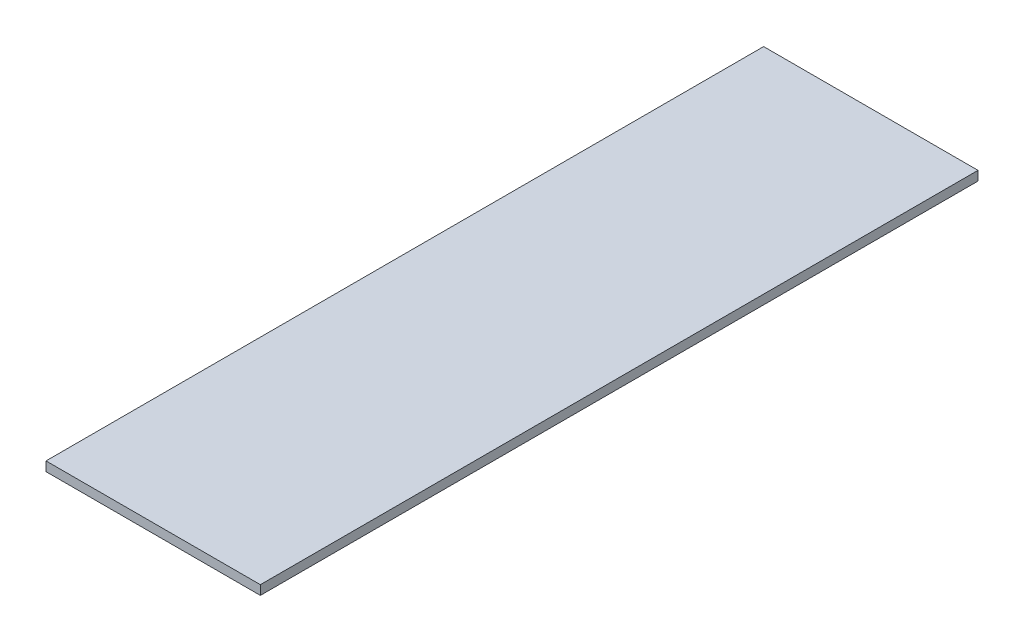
ISO-10303-21;
HEADER;
FILE_DESCRIPTION(('STEP AP214'),'2;1');
FILE_NAME('part.step','',(''),(''),'','','');
FILE_SCHEMA(('AUTOMOTIVE_DESIGN { 1 0 10303 214 1 1 1 1 }'));
ENDSEC;
DATA;
#1=APPLICATION_CONTEXT('core data for automotive mechanical design processes');
#2=APPLICATION_PROTOCOL_DEFINITION('international standard','automotive_design',2000,#1);
#3=PRODUCT_CONTEXT('',#1,'mechanical');
#4=PRODUCT('Part','Part','',(#3));
#5=PRODUCT_RELATED_PRODUCT_CATEGORY('part','',(#4));
#6=PRODUCT_DEFINITION_FORMATION('','',#4);
#7=PRODUCT_DEFINITION_CONTEXT('part definition',#1,'design');
#8=PRODUCT_DEFINITION('design','',#6,#7);
#9=PRODUCT_DEFINITION_SHAPE('','',#8);
#10=(LENGTH_UNIT() NAMED_UNIT(*) SI_UNIT(.MILLI.,.METRE.));
#11=(NAMED_UNIT(*) PLANE_ANGLE_UNIT() SI_UNIT($,.RADIAN.));
#12=(NAMED_UNIT(*) SI_UNIT($,.STERADIAN.) SOLID_ANGLE_UNIT());
#13=UNCERTAINTY_MEASURE_WITH_UNIT(LENGTH_MEASURE(1.E-05),#10,'distance_accuracy_value','');
#14=(GEOMETRIC_REPRESENTATION_CONTEXT(3) GLOBAL_UNCERTAINTY_ASSIGNED_CONTEXT((#13)) GLOBAL_UNIT_ASSIGNED_CONTEXT((#10,
#11,#12)) REPRESENTATION_CONTEXT('',''));
#15=CARTESIAN_POINT('',(0.,0.,0.));
#16=DIRECTION('',(0.,0.,1.));
#17=DIRECTION('',(1.,0.,0.));
#18=AXIS2_PLACEMENT_3D('',#15,#16,#17);
#19=CARTESIAN_POINT('',(-292.1,12.7,0.));
#20=DIRECTION('',(0.,0.,1.));
#21=DIRECTION('',(1.,0.,0.));
#22=AXIS2_PLACEMENT_3D('',#19,#20,#21);
#23=PLANE('',#22);
#24=DIRECTION('',(-1.,0.,0.));
#25=VECTOR('',#24,1.);
#26=CARTESIAN_POINT('',(-292.1,0.,0.));
#27=LINE('',#26,#25);
#28=CARTESIAN_POINT('',(0.,0.,0.));
#29=VERTEX_POINT('',#28);
#30=CARTESIAN_POINT('',(-292.1,0.,0.));
#31=VERTEX_POINT('',#30);
#32=EDGE_CURVE('E96',#29,#31,#27,.T.);
#33=ORIENTED_EDGE('',*,*,#32,.T.);
#34=DIRECTION('',(0.,-1.,0.));
#35=VECTOR('',#34,1.);
#36=CARTESIAN_POINT('',(-292.1,12.7,0.));
#37=LINE('',#36,#35);
#38=CARTESIAN_POINT('',(-292.1,12.7,0.));
#39=VERTEX_POINT('',#38);
#40=EDGE_CURVE('E11',#39,#31,#37,.T.);
#41=ORIENTED_EDGE('',*,*,#40,.F.);
#42=DIRECTION('',(-1.,0.,0.));
#43=VECTOR('',#42,1.);
#44=CARTESIAN_POINT('',(-292.1,12.7,0.));
#45=LINE('',#44,#43);
#46=CARTESIAN_POINT('',(0.,12.7,0.));
#47=VERTEX_POINT('',#46);
#48=EDGE_CURVE('E84',#47,#39,#45,.T.);
#49=ORIENTED_EDGE('',*,*,#48,.F.);
#50=DIRECTION('',(0.,-1.,0.));
#51=VECTOR('',#50,1.);
#52=CARTESIAN_POINT('',(0.,12.7,0.));
#53=LINE('',#52,#51);
#54=EDGE_CURVE('E92',#47,#29,#53,.T.);
#55=ORIENTED_EDGE('',*,*,#54,.T.);
#56=EDGE_LOOP('',(#33,#41,#49,#55));
#57=FACE_BOUND('',#56,.T.);
#58=ADVANCED_FACE('F33',(#57),#23,.F.);
#59=CARTESIAN_POINT('',(-292.1,12.7,977.9));
#60=DIRECTION('',(1.,0.,0.));
#61=DIRECTION('',(0.,0.,-1.));
#62=AXIS2_PLACEMENT_3D('',#59,#60,#61);
#63=PLANE('',#62);
#64=DIRECTION('',(0.,0.,1.));
#65=VECTOR('',#64,1.);
#66=CARTESIAN_POINT('',(-292.1,0.,977.9));
#67=LINE('',#66,#65);
#68=CARTESIAN_POINT('',(-292.1,0.,977.9));
#69=VERTEX_POINT('',#68);
#70=EDGE_CURVE('E88',#31,#69,#67,.T.);
#71=ORIENTED_EDGE('',*,*,#70,.T.);
#72=DIRECTION('',(0.,-1.,0.));
#73=VECTOR('',#72,1.);
#74=CARTESIAN_POINT('',(-292.1,12.7,977.9));
#75=LINE('',#74,#73);
#76=CARTESIAN_POINT('',(-292.1,12.7,977.9));
#77=VERTEX_POINT('',#76);
#78=EDGE_CURVE('E41',#77,#69,#75,.T.);
#79=ORIENTED_EDGE('',*,*,#78,.F.);
#80=DIRECTION('',(0.,0.,1.));
#81=VECTOR('',#80,1.);
#82=CARTESIAN_POINT('',(-292.1,12.7,977.9));
#83=LINE('',#82,#81);
#84=EDGE_CURVE('E79',#39,#77,#83,.T.);
#85=ORIENTED_EDGE('',*,*,#84,.F.);
#86=ORIENTED_EDGE('',*,*,#40,.T.);
#87=EDGE_LOOP('',(#71,#79,#85,#86));
#88=FACE_BOUND('',#87,.T.);
#89=ADVANCED_FACE('F87',(#88),#63,.F.);
#90=CARTESIAN_POINT('',(1.1975821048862E-13,12.7,977.9));
#91=DIRECTION('',(0.,0.,-1.));
#92=DIRECTION('',(-1.,0.,0.));
#93=AXIS2_PLACEMENT_3D('',#90,#91,#92);
#94=PLANE('',#93);
#95=DIRECTION('',(1.,0.,0.));
#96=VECTOR('',#95,1.);
#97=CARTESIAN_POINT('',(1.1975821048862E-13,0.,977.9));
#98=LINE('',#97,#96);
#99=CARTESIAN_POINT('',(1.1975821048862E-13,0.,977.9));
#100=VERTEX_POINT('',#99);
#101=EDGE_CURVE('E66',#69,#100,#98,.T.);
#102=ORIENTED_EDGE('',*,*,#101,.T.);
#103=DIRECTION('',(0.,-1.,0.));
#104=VECTOR('',#103,1.);
#105=CARTESIAN_POINT('',(1.1975821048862E-13,12.7,977.9));
#106=LINE('',#105,#104);
#107=CARTESIAN_POINT('',(1.1975821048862E-13,12.7,977.9));
#108=VERTEX_POINT('',#107);
#109=EDGE_CURVE('E89',#108,#100,#106,.T.);
#110=ORIENTED_EDGE('',*,*,#109,.F.);
#111=DIRECTION('',(1.,0.,0.));
#112=VECTOR('',#111,1.);
#113=CARTESIAN_POINT('',(1.1975821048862E-13,12.7,977.9));
#114=LINE('',#113,#112);
#115=EDGE_CURVE('E82',#77,#108,#114,.T.);
#116=ORIENTED_EDGE('',*,*,#115,.F.);
#117=ORIENTED_EDGE('',*,*,#78,.T.);
#118=EDGE_LOOP('',(#102,#110,#116,#117));
#119=FACE_BOUND('',#118,.T.);
#120=ADVANCED_FACE('F90',(#119),#94,.F.);
#121=CARTESIAN_POINT('',(0.,12.7,0.));
#122=DIRECTION('',(-1.,0.,0.));
#123=DIRECTION('',(0.,0.,1.));
#124=AXIS2_PLACEMENT_3D('',#121,#122,#123);
#125=PLANE('',#124);
#126=DIRECTION('',(0.,0.,-1.));
#127=VECTOR('',#126,1.);
#128=CARTESIAN_POINT('',(0.,0.,0.));
#129=LINE('',#128,#127);
#130=EDGE_CURVE('E72',#100,#29,#129,.T.);
#131=ORIENTED_EDGE('',*,*,#130,.T.);
#132=ORIENTED_EDGE('',*,*,#54,.F.);
#133=DIRECTION('',(0.,0.,-1.));
#134=VECTOR('',#133,1.);
#135=CARTESIAN_POINT('',(0.,12.7,0.));
#136=LINE('',#135,#134);
#137=EDGE_CURVE('E49',#108,#47,#136,.T.);
#138=ORIENTED_EDGE('',*,*,#137,.F.);
#139=ORIENTED_EDGE('',*,*,#109,.T.);
#140=EDGE_LOOP('',(#131,#132,#138,#139));
#141=FACE_BOUND('',#140,.T.);
#142=ADVANCED_FACE('F103',(#141),#125,.F.);
#143=CARTESIAN_POINT('',(0.,12.7,0.));
#144=DIRECTION('',(0.,-1.,0.));
#145=DIRECTION('',(0.,0.,-1.));
#146=AXIS2_PLACEMENT_3D('',#143,#144,#145);
#147=PLANE('',#146);
#148=ORIENTED_EDGE('',*,*,#48,.T.);
#149=ORIENTED_EDGE('',*,*,#84,.T.);
#150=ORIENTED_EDGE('',*,*,#115,.T.);
#151=ORIENTED_EDGE('',*,*,#137,.T.);
#152=EDGE_LOOP('',(#148,#149,#150,#151));
#153=FACE_BOUND('',#152,.T.);
#154=ADVANCED_FACE('F80',(#153),#147,.F.);
#155=CARTESIAN_POINT('',(0.,0.,0.));
#156=DIRECTION('',(0.,-1.,0.));
#157=DIRECTION('',(0.,0.,-1.));
#158=AXIS2_PLACEMENT_3D('',#155,#156,#157);
#159=PLANE('',#158);
#160=ORIENTED_EDGE('',*,*,#32,.F.);
#161=ORIENTED_EDGE('',*,*,#130,.F.);
#162=ORIENTED_EDGE('',*,*,#101,.F.);
#163=ORIENTED_EDGE('',*,*,#70,.F.);
#164=EDGE_LOOP('',(#160,#161,#162,#163));
#165=FACE_BOUND('',#164,.T.);
#166=ADVANCED_FACE('F106',(#165),#159,.T.);
#167=CLOSED_SHELL('',(#58,#89,#120,#142,#154,#166));
#168=MANIFOLD_SOLID_BREP('B2',#167);
#169=ADVANCED_BREP_SHAPE_REPRESENTATION('',(#18,#168),#14);
#170=SHAPE_DEFINITION_REPRESENTATION(#9,#169);
ENDSEC;
END-ISO-10303-21;
